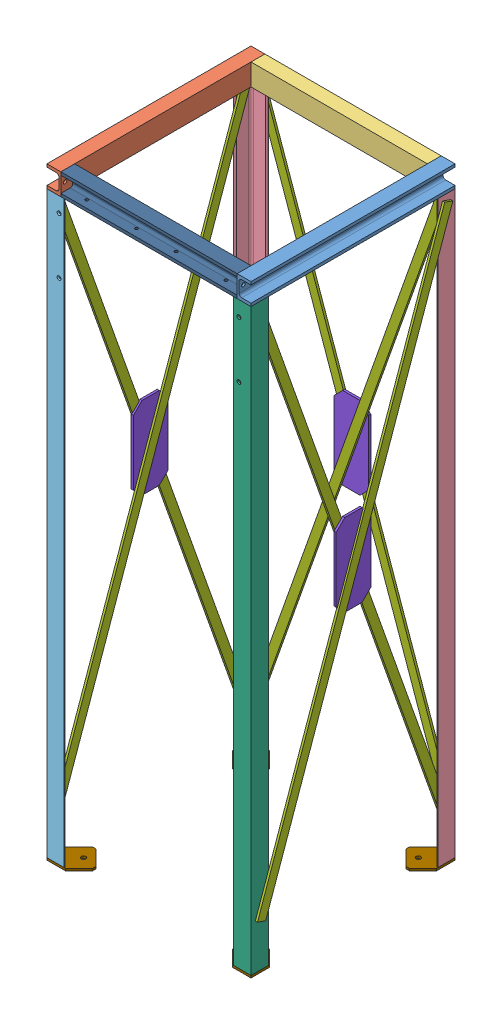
SolidWorks assembly Frame.SLDASM, configuration Initial (file format 14000). Lengths in mm.
Overall size (514.43 1395 514.43).
27 component instances, 12 part files, 3 mates.
Components (placement in the parent):
- Frame-basic-1: Frame-basic.SLDASM [Initial] at origin size (514.43 1395 514.43)
  - 3930-10449-4-01-1: 3930-10449-4-01.SLDPRT [Výchozí] at (220 0 0)
  - 3930-10450-4-01-1: 3930-10450-4-01.SLDPRT [Výchozí] at (-220 0 0) x (-1 0 0) z (0 0 -1)
  - 3930-10451-4-01-1: 3930-10451-4-01.SLDPRT [Výchozí] at (0 0 -220) x (0 0 -1) z (1 0 0)
  - 3930-10454-4-01-2: 3930-10454-4-01.SLDPRT [Výchozí] at (-216 -695 -216) x (1 0 0) z (0 -1 0)
  - 3930-10454-4-01-1: 3930-10454-4-01.SLDPRT [Výchozí] at (216 -695 -216) x (0 0 1) z (0 -1 0)
  - 3930-10455-4-01-1: 3930-10455-4-01.SLDPRT [Výchozí] at (-216 -695 216) x (1 0 0) z (0 1 0)
  - 3930-10456-4-01-1: 3930-10456-4-01.SLDPRT [Výchozí] at (216 -695 216) x (0 0 -1) z (0 1 0)
  - 3930-10459-4-01-4: 3930-10459-4-01.SLDPRT [Výchozí] at (-232 -651.1914 0) x (0 -0.333187 -0.942861) z (1 0 0)
  - 3930-10459-4-01-1: 3930-10459-4-01.SLDPRT [Výchozí] at (-241 -651.1914 0) x (0 0.333187 -0.942861) z (1 0 0)
  - Cross Gusset-1: Cross Gusset.SLDPRT [Výchozí] at (-232 -650 0) x (0 0 1) z (-1 0 0)
  - Feet-1: Feet.SLDPRT [Výchozí] at (-207.7157 -1370 207.7157) x (0.707107 0 -0.707107) z (0 1 0)
  - Feet-2: Feet.SLDPRT [Výchozí] at (207.7157 -1370 207.7157) x (-0.707107 0 -0.707107) z (0 1 0)
  - Feet-3: Feet.SLDPRT [Výchozí] at (207.7157 -1370 -207.7157) x (-0.707107 0 0.707107) z (0 1 0)
  - Feet-4: Feet.SLDPRT [Výchozí] at (-207.7157 -1370 -207.7157) x (0.707107 0 0.707107) z (0 1 0)
  - Cross Gusset-2: Cross Gusset.SLDPRT [Výchozí] at (0 -650 -232) x (-1 0 0) z (0 0 -1)
  - Cross Gusset-3: Cross Gusset.SLDPRT [Výchozí] at (232 -650 0) x (0 0 -1) z (1 0 0)
  - 3930-10459-4-01-5: 3930-10459-4-01.SLDPRT [Výchozí] at (0 -651.1914 -232) x (0.942861 -0.333187 0) z (0 0 1)
  - 3930-10459-4-01-6: 3930-10459-4-01.SLDPRT [Výchozí] at (232 -651.1914 0) x (0 -0.333187 0.942861) z (-1 0 0)
  - 3930-10459-4-01-2: 3930-10459-4-01.SLDPRT [Výchozí] at (0 -651.1914 -241) x (0.942861 0.333187 0) z (0 0 1)
  - 3930-10459-4-01-3: 3930-10459-4-01.SLDPRT [Výchozí] at (241 -651.1914 0) x (0 0.333187 0.942861) z (-1 0 0)
  - 3930-10108-4-01-1: 3930-10108-4-01.SLDPRT [Výchozí] at (-207 -25 217.5) x (0 0 1) z (0 -1 0) (suppressed, hidden)
  - 3930-10108-4-01-2: 3930-10108-4-01.SLDPRT [Výchozí] at (207 -25 217.5) x (0 0 1) z (0 -1 0) (suppressed, hidden)
- Beam-1: Beam.SLDASM [Initial] at (0 0 220) x (0 0 1) z (-1 0 0) size (32 50 408)
  - 3930-10452-4-01-1: 3930-10452-4-01.SLDPRT [Výchozí] at origin
  - 3930-10104-4-01-1: 3930-10104-4-01.SLDPRT [Výchozí] at (2.5 0 199) (suppressed, hidden)
  - 3930-10104-4-01-2: 3930-10104-4-01.SLDPRT [Výchozí] at (2.5 0 -204) (suppressed, hidden)
Mates (geometry in assembly coordinates):
- Sjednocený1: coincident aligned: plane of Frame-basic-1/3930-10450-4-01-1 through (-204 25 -236) normal (0 1 0); plane of Beam-1/3930-10452-4-01-1 through (-204 25 204) normal (0 1 0)
- Sjednocený2: coincident anti-aligned: plane of Frame-basic-1/3930-10450-4-01-1 through (-204 25 -236) normal (1 0 0); plane of Beam-1/3930-10452-4-01-1 through (-204 12.2 214.4) normal (-1 0 0)
- Sjednocený3: coincident aligned: plane of Frame-basic-1/3930-10450-4-01-1 through (-214.4 12.2 236) normal (0 0 1); plane of Beam-1/3930-10452-4-01-1 through (-204 25 236) normal (0 0 1)
